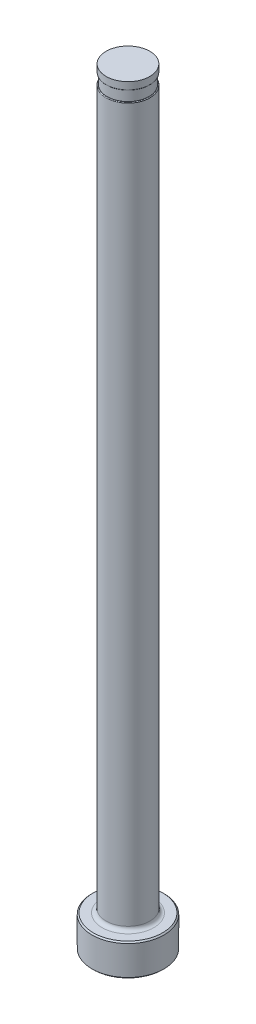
from build123d import *

# Parameters (mm, degrees)
CHAMFER1_SIZE     = 0.254
FILLET1_R         = 0.762
SKETCH2_W         = 0.2032
SKETCH2_H         = 2.032
D_SLOT_DEPTH      = 153.73390245
D_SLOT_DEPTH_BACK = 153.73390245
SKETCH5_W         = 0.0254
SKETCH5_H         = 1.524
FILLET2_R         = 0.127


with BuildPart() as part:
    # Sketch1 → Revolve1 (revolve)
    with BuildSketch(Plane.XY, mode=Mode.PRIVATE) as revolve1_sk:
        Polygon((0, 0), (-7.1374, 0), (-7.1374, 6.35), (-4.36499, 6.35), (-4.36499, 152.4), (0, 152.4), align=None)
    revolve(revolve1_sk.sketch.rotate(Axis((0, 259.958771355, 0), (0, -1, 0)), 270), axis=Axis((0, 259.958771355, 0), (0, -1, 0)))

    # Chamfer1
    chamfer1_edges = [part.edges().sort_by_distance(p)[0] for p in [
        (0, 6.35, -7.1374),
        (0, 0, -7.1374),
    ]]
    chamfer(chamfer1_edges, length=CHAMFER1_SIZE)

    # Fillet1
    fillet1_edges = [part.edges().sort_by_distance(p)[0] for p in [
        (0, 6.35, -4.36499),
    ]]
    fillet(fillet1_edges, radius=FILLET1_R)

    # Sketch2 → Vent Relief (revolve, cut)
    with BuildSketch(Plane.XY, mode=Mode.PRIVATE) as vent_relief_sk:
        with Locations((-4.26339, 149.86)):
            Rectangle(SKETCH2_W, SKETCH2_H)
    revolve(vent_relief_sk.sketch.rotate(Axis((0, 153.448281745, 0), (0, -1, 0)), 270), axis=Axis((0, 153.448281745, 0), (0, -1, 0)), mode=Mode.SUBTRACT)

    # Sketch3 → D-Slot (cut, two sides: drawn at the far end of the back side and taken through both)
    with BuildSketch(Plane.XY.offset(-D_SLOT_DEPTH_BACK)):
        with BuildLine():
            Line((-4.16179, 149.86), (-4.16179, 86.36))
            ThreePointArc((-4.16179, 86.36), (-4.213003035, 85.792038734), (-4.36499, 85.2424))
            Line((-4.36499, 85.2424), (-4.36499, 149.86))
            Line((-4.36499, 149.86), (-4.16179, 149.86))
        make_face()
    extrude(amount=D_SLOT_DEPTH + D_SLOT_DEPTH_BACK, mode=Mode.SUBTRACT)

    # Sketch5 → Vent Diameter (revolve, cut)
    with BuildSketch(Plane.XY, mode=Mode.PRIVATE) as vent_diameter_sk:
        with Locations((-4.35229, 151.638)):
            Rectangle(SKETCH5_W, SKETCH5_H)
    revolve(vent_diameter_sk.sketch.rotate(Axis((0, 152.687735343, 0), (0, -1, 0)), 90), axis=Axis((0, 152.687735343, 0), (0, -1, 0)), mode=Mode.SUBTRACT)

    # Fillet2
    fillet2_edges = [part.edges().sort_by_distance(p)[0] for p in [
        (3.521275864, 148.844, -2.579487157),
        (0, 150.876, 4.33959),
    ]]
    fillet(fillet2_edges, radius=FILLET2_R)


solid = part.part
